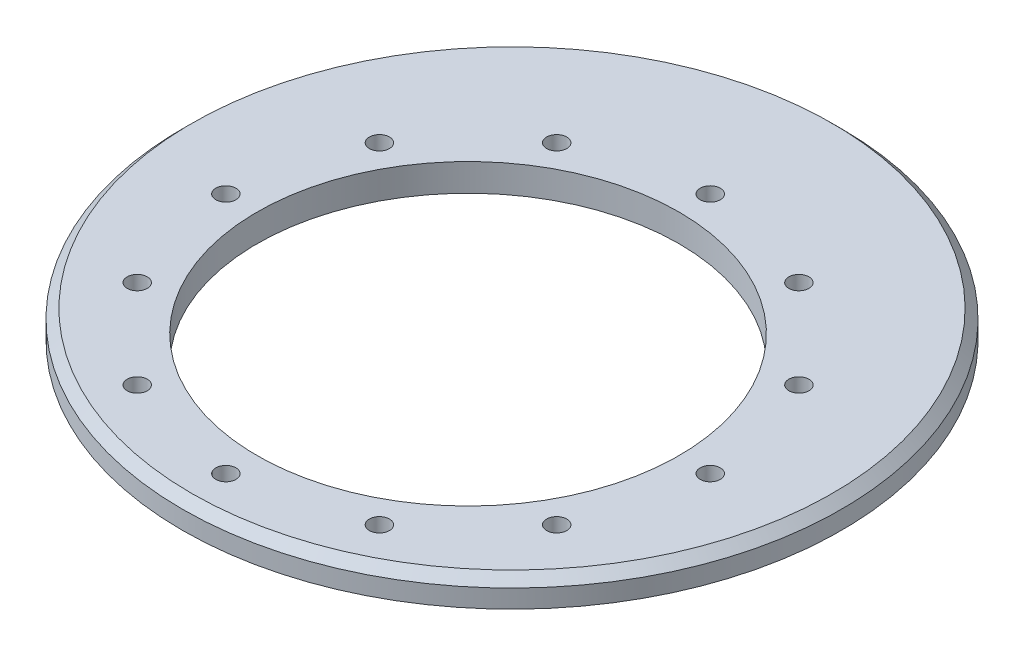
from build123d import *

# Parameters (mm, degrees)
SKETCH1_R         = 114.3
EXTRUDE1_DEPTH    = 9.525
CHAMFER1_SIZE     = 3.175
SKETCH2_R         = 3.4905
EXTRUDE2_DEPTH    = 162.925
CIRPATTERN1_COUNT = 12
SKETCH3_R         = 73.175
EXTRUDE3_DEPTH    = 162.925


with BuildPart() as part:
    # Sketch1 → Extrude1 (new body)
    with BuildSketch(Plane(origin=(0, 0, 0), x_dir=(1, 0, 0), z_dir=(0, 1, 0))):
        with Locations(Location((0, 0, 0), (0, 0, 270))):
            Circle(SKETCH1_R)
    extrude(amount=-EXTRUDE1_DEPTH)

    # Chamfer1
    chamfer1_edges = [part.edges().sort_by_distance(p)[0] for p in [
        (0, 0, -114.3),
    ]]
    chamfer(chamfer1_edges, length=CHAMFER1_SIZE)

    # Sketch2 → Extrude2 (cut, through all)
    with BuildSketch(Plane(origin=(0, -9.525, 0), x_dir=(-1, 0, 0), z_dir=(0, -1, 0))):
        with Locations(Location((0, -99.24, 0), (0, 0, 90))):
            Circle(SKETCH2_R)
    extrude2 = extrude(amount=-EXTRUDE2_DEPTH, mode=Mode.SUBTRACT)

    # CirPattern1: Extrude2 ×12 about axis
    cirpattern1_axis = Axis((0, 0, 15.24), (0, 1, 0))
    for i in range(1, CIRPATTERN1_COUNT):
        add(extrude2.rotate(cirpattern1_axis, i * 360 / CIRPATTERN1_COUNT), mode=Mode.SUBTRACT)

    # Sketch3 → Extrude3 (cut, through all)
    with BuildSketch(Plane(origin=(0, -9.525, 0), x_dir=(-1, 0, 0), z_dir=(0, -1, 0))):
        with Locations(Location((0, -15.24, 0), (0, 0, 90))):
            Circle(SKETCH3_R)
    extrude(amount=-EXTRUDE3_DEPTH, mode=Mode.SUBTRACT)


solid = part.part
